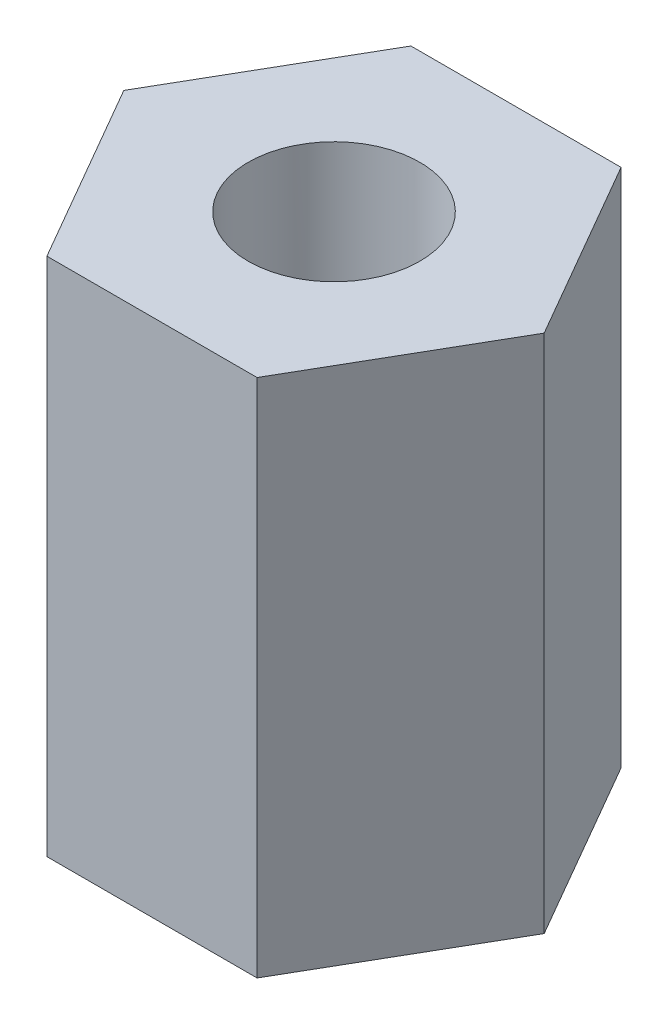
ISO-10303-21;
HEADER;
FILE_DESCRIPTION(('STEP AP214'),'2;1');
FILE_NAME('part.step','',(''),(''),'','','');
FILE_SCHEMA(('AUTOMOTIVE_DESIGN { 1 0 10303 214 1 1 1 1 }'));
ENDSEC;
DATA;
#1=APPLICATION_CONTEXT('core data for automotive mechanical design processes');
#2=APPLICATION_PROTOCOL_DEFINITION('international standard','automotive_design',2000,#1);
#3=PRODUCT_CONTEXT('',#1,'mechanical');
#4=PRODUCT('Part','Part','',(#3));
#5=PRODUCT_RELATED_PRODUCT_CATEGORY('part','',(#4));
#6=PRODUCT_DEFINITION_FORMATION('','',#4);
#7=PRODUCT_DEFINITION_CONTEXT('part definition',#1,'design');
#8=PRODUCT_DEFINITION('design','',#6,#7);
#9=PRODUCT_DEFINITION_SHAPE('','',#8);
#10=(LENGTH_UNIT() NAMED_UNIT(*) SI_UNIT(.MILLI.,.METRE.));
#11=(NAMED_UNIT(*) PLANE_ANGLE_UNIT() SI_UNIT($,.RADIAN.));
#12=(NAMED_UNIT(*) SI_UNIT($,.STERADIAN.) SOLID_ANGLE_UNIT());
#13=UNCERTAINTY_MEASURE_WITH_UNIT(LENGTH_MEASURE(1.E-05),#10,'distance_accuracy_value','');
#14=(GEOMETRIC_REPRESENTATION_CONTEXT(3) GLOBAL_UNCERTAINTY_ASSIGNED_CONTEXT((#13)) GLOBAL_UNIT_ASSIGNED_CONTEXT((#10,
#11,#12)) REPRESENTATION_CONTEXT('',''));
#15=CARTESIAN_POINT('',(0.,0.,0.));
#16=DIRECTION('',(0.,0.,1.));
#17=DIRECTION('',(1.,0.,0.));
#18=AXIS2_PLACEMENT_3D('',#15,#16,#17);
#19=CARTESIAN_POINT('',(4.04145188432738,10.,0.));
#20=DIRECTION('',(-0.866025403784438,0.,0.5));
#21=DIRECTION('',(0.5,0.,0.866025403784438));
#22=AXIS2_PLACEMENT_3D('',#19,#20,#21);
#23=PLANE('',#22);
#24=DIRECTION('',(-0.5,0.,-0.866025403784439));
#25=VECTOR('',#24,1.);
#26=CARTESIAN_POINT('',(4.04145188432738,0.,0.));
#27=LINE('',#26,#25);
#28=CARTESIAN_POINT('',(4.04145188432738,0.,0.));
#29=VERTEX_POINT('',#28);
#30=CARTESIAN_POINT('',(2.02072594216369,0.,-3.5));
#31=VERTEX_POINT('',#30);
#32=EDGE_CURVE('E136',#29,#31,#27,.T.);
#33=ORIENTED_EDGE('',*,*,#32,.T.);
#34=DIRECTION('',(0.,-1.,0.));
#35=VECTOR('',#34,1.);
#36=CARTESIAN_POINT('',(2.02072594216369,10.,-3.5));
#37=LINE('',#36,#35);
#38=CARTESIAN_POINT('',(2.02072594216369,10.,-3.5));
#39=VERTEX_POINT('',#38);
#40=EDGE_CURVE('E13',#39,#31,#37,.T.);
#41=ORIENTED_EDGE('',*,*,#40,.F.);
#42=DIRECTION('',(-0.5,0.,-0.866025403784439));
#43=VECTOR('',#42,1.);
#44=CARTESIAN_POINT('',(4.04145188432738,10.,0.));
#45=LINE('',#44,#43);
#46=CARTESIAN_POINT('',(4.04145188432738,10.,0.));
#47=VERTEX_POINT('',#46);
#48=EDGE_CURVE('E147',#47,#39,#45,.T.);
#49=ORIENTED_EDGE('',*,*,#48,.F.);
#50=DIRECTION('',(0.,-1.,0.));
#51=VECTOR('',#50,1.);
#52=CARTESIAN_POINT('',(4.04145188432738,10.,0.));
#53=LINE('',#52,#51);
#54=EDGE_CURVE('E132',#47,#29,#53,.T.);
#55=ORIENTED_EDGE('',*,*,#54,.T.);
#56=EDGE_LOOP('',(#33,#41,#49,#55));
#57=FACE_BOUND('',#56,.T.);
#58=ADVANCED_FACE('F52',(#57),#23,.F.);
#59=CARTESIAN_POINT('',(2.02072594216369,10.,-3.5));
#60=DIRECTION('',(0.,0.,1.));
#61=DIRECTION('',(1.,0.,0.));
#62=AXIS2_PLACEMENT_3D('',#59,#60,#61);
#63=PLANE('',#62);
#64=DIRECTION('',(-1.,0.,0.));
#65=VECTOR('',#64,1.);
#66=CARTESIAN_POINT('',(2.02072594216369,0.,-3.5));
#67=LINE('',#66,#65);
#68=CARTESIAN_POINT('',(-2.02072594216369,0.,-3.5));
#69=VERTEX_POINT('',#68);
#70=EDGE_CURVE('E139',#31,#69,#67,.T.);
#71=ORIENTED_EDGE('',*,*,#70,.T.);
#72=DIRECTION('',(0.,-1.,0.));
#73=VECTOR('',#72,1.);
#74=CARTESIAN_POINT('',(-2.02072594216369,10.,-3.5));
#75=LINE('',#74,#73);
#76=CARTESIAN_POINT('',(-2.02072594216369,10.,-3.5));
#77=VERTEX_POINT('',#76);
#78=EDGE_CURVE('E60',#77,#69,#75,.T.);
#79=ORIENTED_EDGE('',*,*,#78,.F.);
#80=DIRECTION('',(-1.,0.,0.));
#81=VECTOR('',#80,1.);
#82=CARTESIAN_POINT('',(2.02072594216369,10.,-3.5));
#83=LINE('',#82,#81);
#84=EDGE_CURVE('E105',#39,#77,#83,.T.);
#85=ORIENTED_EDGE('',*,*,#84,.F.);
#86=ORIENTED_EDGE('',*,*,#40,.T.);
#87=EDGE_LOOP('',(#71,#79,#85,#86));
#88=FACE_BOUND('',#87,.T.);
#89=ADVANCED_FACE('F173',(#88),#63,.F.);
#90=CARTESIAN_POINT('',(-2.02072594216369,10.,-3.5));
#91=DIRECTION('',(0.866025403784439,0.,0.5));
#92=DIRECTION('',(0.5,0.,-0.866025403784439));
#93=AXIS2_PLACEMENT_3D('',#90,#91,#92);
#94=PLANE('',#93);
#95=DIRECTION('',(-0.5,0.,0.866025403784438));
#96=VECTOR('',#95,1.);
#97=CARTESIAN_POINT('',(-2.02072594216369,0.,-3.5));
#98=LINE('',#97,#96);
#99=CARTESIAN_POINT('',(-4.04145188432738,0.,0.));
#100=VERTEX_POINT('',#99);
#101=EDGE_CURVE('E142',#69,#100,#98,.T.);
#102=ORIENTED_EDGE('',*,*,#101,.T.);
#103=DIRECTION('',(0.,-1.,0.));
#104=VECTOR('',#103,1.);
#105=CARTESIAN_POINT('',(-4.04145188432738,10.,0.));
#106=LINE('',#105,#104);
#107=CARTESIAN_POINT('',(-4.04145188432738,10.,0.));
#108=VERTEX_POINT('',#107);
#109=EDGE_CURVE('E127',#108,#100,#106,.T.);
#110=ORIENTED_EDGE('',*,*,#109,.F.);
#111=DIRECTION('',(-0.5,0.,0.866025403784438));
#112=VECTOR('',#111,1.);
#113=CARTESIAN_POINT('',(-2.02072594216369,10.,-3.5));
#114=LINE('',#113,#112);
#115=EDGE_CURVE('E118',#77,#108,#114,.T.);
#116=ORIENTED_EDGE('',*,*,#115,.F.);
#117=ORIENTED_EDGE('',*,*,#78,.T.);
#118=EDGE_LOOP('',(#102,#110,#116,#117));
#119=FACE_BOUND('',#118,.T.);
#120=ADVANCED_FACE('F154',(#119),#94,.F.);
#121=CARTESIAN_POINT('',(-4.04145188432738,10.,0.));
#122=DIRECTION('',(0.866025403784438,0.,-0.5));
#123=DIRECTION('',(-0.5,0.,-0.866025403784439));
#124=AXIS2_PLACEMENT_3D('',#121,#122,#123);
#125=PLANE('',#124);
#126=DIRECTION('',(0.5,0.,0.866025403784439));
#127=VECTOR('',#126,1.);
#128=CARTESIAN_POINT('',(-4.04145188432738,0.,0.));
#129=LINE('',#128,#127);
#130=CARTESIAN_POINT('',(-2.02072594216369,0.,3.5));
#131=VERTEX_POINT('',#130);
#132=EDGE_CURVE('E126',#100,#131,#129,.T.);
#133=ORIENTED_EDGE('',*,*,#132,.T.);
#134=DIRECTION('',(0.,-1.,0.));
#135=VECTOR('',#134,1.);
#136=CARTESIAN_POINT('',(-2.02072594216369,10.,3.5));
#137=LINE('',#136,#135);
#138=CARTESIAN_POINT('',(-2.02072594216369,10.,3.5));
#139=VERTEX_POINT('',#138);
#140=EDGE_CURVE('E123',#139,#131,#137,.T.);
#141=ORIENTED_EDGE('',*,*,#140,.F.);
#142=DIRECTION('',(0.5,0.,0.866025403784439));
#143=VECTOR('',#142,1.);
#144=CARTESIAN_POINT('',(-4.04145188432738,10.,0.));
#145=LINE('',#144,#143);
#146=EDGE_CURVE('E112',#108,#139,#145,.T.);
#147=ORIENTED_EDGE('',*,*,#146,.F.);
#148=ORIENTED_EDGE('',*,*,#109,.T.);
#149=EDGE_LOOP('',(#133,#141,#147,#148));
#150=FACE_BOUND('',#149,.T.);
#151=ADVANCED_FACE('F124',(#150),#125,.F.);
#152=CARTESIAN_POINT('',(-2.02072594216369,10.,3.5));
#153=DIRECTION('',(0.,0.,-1.));
#154=DIRECTION('',(-1.,0.,0.));
#155=AXIS2_PLACEMENT_3D('',#152,#153,#154);
#156=PLANE('',#155);
#157=DIRECTION('',(1.,0.,0.));
#158=VECTOR('',#157,1.);
#159=CARTESIAN_POINT('',(-2.02072594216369,0.,3.5));
#160=LINE('',#159,#158);
#161=CARTESIAN_POINT('',(2.02072594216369,0.,3.5));
#162=VERTEX_POINT('',#161);
#163=EDGE_CURVE('E91',#131,#162,#160,.T.);
#164=ORIENTED_EDGE('',*,*,#163,.T.);
#165=DIRECTION('',(0.,-1.,0.));
#166=VECTOR('',#165,1.);
#167=CARTESIAN_POINT('',(2.02072594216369,10.,3.5));
#168=LINE('',#167,#166);
#169=CARTESIAN_POINT('',(2.02072594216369,10.,3.5));
#170=VERTEX_POINT('',#169);
#171=EDGE_CURVE('E128',#170,#162,#168,.T.);
#172=ORIENTED_EDGE('',*,*,#171,.F.);
#173=DIRECTION('',(1.,0.,0.));
#174=VECTOR('',#173,1.);
#175=CARTESIAN_POINT('',(-2.02072594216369,10.,3.5));
#176=LINE('',#175,#174);
#177=EDGE_CURVE('E116',#139,#170,#176,.T.);
#178=ORIENTED_EDGE('',*,*,#177,.F.);
#179=ORIENTED_EDGE('',*,*,#140,.T.);
#180=EDGE_LOOP('',(#164,#172,#178,#179));
#181=FACE_BOUND('',#180,.T.);
#182=ADVANCED_FACE('F130',(#181),#156,.F.);
#183=CARTESIAN_POINT('',(2.02072594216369,10.,3.5));
#184=DIRECTION('',(-0.866025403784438,0.,-0.5));
#185=DIRECTION('',(-0.5,0.,0.866025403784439));
#186=AXIS2_PLACEMENT_3D('',#183,#184,#185);
#187=PLANE('',#186);
#188=DIRECTION('',(0.5,0.,-0.866025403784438));
#189=VECTOR('',#188,1.);
#190=CARTESIAN_POINT('',(2.02072594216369,0.,3.5));
#191=LINE('',#190,#189);
#192=EDGE_CURVE('E97',#162,#29,#191,.T.);
#193=ORIENTED_EDGE('',*,*,#192,.T.);
#194=ORIENTED_EDGE('',*,*,#54,.F.);
#195=DIRECTION('',(0.5,0.,-0.866025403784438));
#196=VECTOR('',#195,1.);
#197=CARTESIAN_POINT('',(2.02072594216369,10.,3.5));
#198=LINE('',#197,#196);
#199=EDGE_CURVE('E68',#170,#47,#198,.T.);
#200=ORIENTED_EDGE('',*,*,#199,.F.);
#201=ORIENTED_EDGE('',*,*,#171,.T.);
#202=EDGE_LOOP('',(#193,#194,#200,#201));
#203=FACE_BOUND('',#202,.T.);
#204=ADVANCED_FACE('F161',(#203),#187,.F.);
#205=CARTESIAN_POINT('',(0.,10.,0.));
#206=DIRECTION('',(0.,1.,0.));
#207=DIRECTION('',(0.,0.,1.));
#208=AXIS2_PLACEMENT_3D('',#205,#206,#207);
#209=PLANE('',#208);
#210=CARTESIAN_POINT('',(0.,10.,0.));
#211=DIRECTION('',(0.,1.,0.));
#212=DIRECTION('',(0.,0.,1.));
#213=AXIS2_PLACEMENT_3D('',#210,#211,#212);
#214=CIRCLE('',#213,1.65);
#215=CARTESIAN_POINT('',(0.,10.,1.65));
#216=VERTEX_POINT('',#215);
#217=EDGE_CURVE('E140',#216,#216,#214,.T.);
#218=ORIENTED_EDGE('',*,*,#217,.F.);
#219=EDGE_LOOP('',(#218));
#220=FACE_BOUND('',#219,.T.);
#221=ORIENTED_EDGE('',*,*,#48,.T.);
#222=ORIENTED_EDGE('',*,*,#84,.T.);
#223=ORIENTED_EDGE('',*,*,#115,.T.);
#224=ORIENTED_EDGE('',*,*,#146,.T.);
#225=ORIENTED_EDGE('',*,*,#177,.T.);
#226=ORIENTED_EDGE('',*,*,#199,.T.);
#227=EDGE_LOOP('',(#221,#222,#223,#224,#225,#226));
#228=FACE_BOUND('',#227,.T.);
#229=ADVANCED_FACE('F114',(#220,#228),#209,.T.);
#230=CARTESIAN_POINT('',(0.,0.,0.));
#231=DIRECTION('',(0.,1.,0.));
#232=DIRECTION('',(0.,0.,1.));
#233=AXIS2_PLACEMENT_3D('',#230,#231,#232);
#234=PLANE('',#233);
#235=CARTESIAN_POINT('',(0.,0.,0.));
#236=DIRECTION('',(0.,-1.,0.));
#237=DIRECTION('',(0.,0.,-1.));
#238=AXIS2_PLACEMENT_3D('',#235,#236,#237);
#239=CIRCLE('',#238,1.65);
#240=CARTESIAN_POINT('',(0.,0.,-1.65));
#241=VERTEX_POINT('',#240);
#242=EDGE_CURVE('E250',#241,#241,#239,.T.);
#243=ORIENTED_EDGE('',*,*,#242,.F.);
#244=EDGE_LOOP('',(#243));
#245=FACE_BOUND('',#244,.T.);
#246=ORIENTED_EDGE('',*,*,#32,.F.);
#247=ORIENTED_EDGE('',*,*,#192,.F.);
#248=ORIENTED_EDGE('',*,*,#163,.F.);
#249=ORIENTED_EDGE('',*,*,#132,.F.);
#250=ORIENTED_EDGE('',*,*,#101,.F.);
#251=ORIENTED_EDGE('',*,*,#70,.F.);
#252=EDGE_LOOP('',(#246,#247,#248,#249,#250,#251));
#253=FACE_BOUND('',#252,.T.);
#254=ADVANCED_FACE('F157',(#245,#253),#234,.F.);
#255=CARTESIAN_POINT('',(0.,5.,0.));
#256=DIRECTION('',(0.,1.,0.));
#257=DIRECTION('',(0.,0.,1.));
#258=AXIS2_PLACEMENT_3D('',#255,#256,#257);
#259=CYLINDRICAL_SURFACE('',#258,1.65);
#260=ORIENTED_EDGE('',*,*,#217,.T.);
#261=EDGE_LOOP('',(#260));
#262=FACE_BOUND('',#261,.T.);
#263=ORIENTED_EDGE('',*,*,#242,.T.);
#264=EDGE_LOOP('',(#263));
#265=FACE_BOUND('',#264,.T.);
#266=ADVANCED_FACE('F213',(#262,#265),#259,.F.);
#267=CLOSED_SHELL('',(#58,#89,#120,#151,#182,#204,#229,#254,#266));
#268=MANIFOLD_SOLID_BREP('B2',#267);
#269=ADVANCED_BREP_SHAPE_REPRESENTATION('',(#18,#268),#14);
#270=SHAPE_DEFINITION_REPRESENTATION(#9,#269);
ENDSEC;
END-ISO-10303-21;
